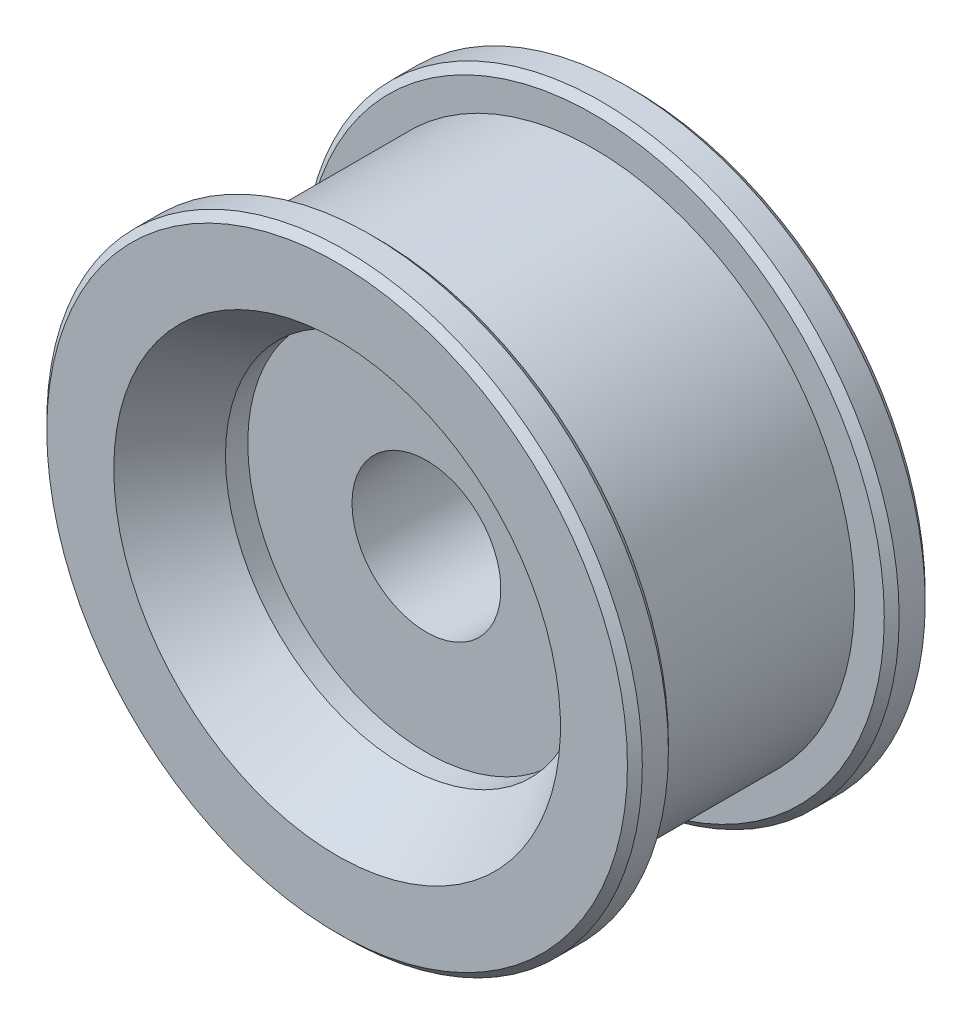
ISO-10303-21;
HEADER;
FILE_DESCRIPTION(('STEP AP214'),'2;1');
FILE_NAME('part.step','',(''),(''),'','','');
FILE_SCHEMA(('AUTOMOTIVE_DESIGN { 1 0 10303 214 1 1 1 1 }'));
ENDSEC;
DATA;
#1=APPLICATION_CONTEXT('core data for automotive mechanical design processes');
#2=APPLICATION_PROTOCOL_DEFINITION('international standard','automotive_design',2000,#1);
#3=PRODUCT_CONTEXT('',#1,'mechanical');
#4=PRODUCT('Part','Part','',(#3));
#5=PRODUCT_RELATED_PRODUCT_CATEGORY('part','',(#4));
#6=PRODUCT_DEFINITION_FORMATION('','',#4);
#7=PRODUCT_DEFINITION_CONTEXT('part definition',#1,'design');
#8=PRODUCT_DEFINITION('design','',#6,#7);
#9=PRODUCT_DEFINITION_SHAPE('','',#8);
#10=(LENGTH_UNIT() NAMED_UNIT(*) SI_UNIT(.MILLI.,.METRE.));
#11=(NAMED_UNIT(*) PLANE_ANGLE_UNIT() SI_UNIT($,.RADIAN.));
#12=(NAMED_UNIT(*) SI_UNIT($,.STERADIAN.) SOLID_ANGLE_UNIT());
#13=UNCERTAINTY_MEASURE_WITH_UNIT(LENGTH_MEASURE(1.E-05),#10,'distance_accuracy_value','');
#14=(GEOMETRIC_REPRESENTATION_CONTEXT(3) GLOBAL_UNCERTAINTY_ASSIGNED_CONTEXT((#13)) GLOBAL_UNIT_ASSIGNED_CONTEXT((#10,
#11,#12)) REPRESENTATION_CONTEXT('',''));
#15=CARTESIAN_POINT('',(0.,0.,0.));
#16=DIRECTION('',(0.,0.,1.));
#17=DIRECTION('',(1.,0.,0.));
#18=AXIS2_PLACEMENT_3D('',#15,#16,#17);
#19=CARTESIAN_POINT('',(0.,5.,-4.));
#20=DIRECTION('',(0.,0.,-1.));
#21=DIRECTION('',(-1.,0.,0.));
#22=AXIS2_PLACEMENT_3D('',#19,#20,#21);
#23=PLANE('',#22);
#24=CARTESIAN_POINT('',(0.,0.,-4.));
#25=DIRECTION('',(0.,0.,-1.));
#26=DIRECTION('',(-1.,0.,0.));
#27=AXIS2_PLACEMENT_3D('',#24,#25,#26);
#28=CIRCLE('',#27,12.);
#29=CARTESIAN_POINT('',(-12.,0.,-4.));
#30=VERTEX_POINT('',#29);
#31=EDGE_CURVE('E71',#30,#30,#28,.T.);
#32=ORIENTED_EDGE('',*,*,#31,.T.);
#33=EDGE_LOOP('',(#32));
#34=FACE_BOUND('',#33,.T.);
#35=CARTESIAN_POINT('',(0.,0.,-4.));
#36=DIRECTION('',(0.,0.,-1.));
#37=DIRECTION('',(-1.,0.,0.));
#38=AXIS2_PLACEMENT_3D('',#35,#36,#37);
#39=CIRCLE('',#38,5.);
#40=CARTESIAN_POINT('',(-5.,0.,-4.));
#41=VERTEX_POINT('',#40);
#42=EDGE_CURVE('E44',#41,#41,#39,.T.);
#43=ORIENTED_EDGE('',*,*,#42,.F.);
#44=EDGE_LOOP('',(#43));
#45=FACE_BOUND('',#44,.T.);
#46=ADVANCED_FACE('F12',(#34,#45),#23,.T.);
#47=CARTESIAN_POINT('',(0.,0.,-20.));
#48=DIRECTION('',(0.,0.,-1.));
#49=DIRECTION('',(-1.,0.,0.));
#50=AXIS2_PLACEMENT_3D('',#47,#48,#49);
#51=CYLINDRICAL_SURFACE('',#50,5.);
#52=ORIENTED_EDGE('',*,*,#42,.T.);
#53=EDGE_LOOP('',(#52));
#54=FACE_BOUND('',#53,.T.);
#55=CARTESIAN_POINT('',(0.,0.,4.));
#56=DIRECTION('',(0.,0.,-1.));
#57=DIRECTION('',(-1.,0.,0.));
#58=AXIS2_PLACEMENT_3D('',#55,#56,#57);
#59=CIRCLE('',#58,5.);
#60=CARTESIAN_POINT('',(-5.,0.,4.));
#61=VERTEX_POINT('',#60);
#62=EDGE_CURVE('E47',#61,#61,#59,.T.);
#63=ORIENTED_EDGE('',*,*,#62,.F.);
#64=EDGE_LOOP('',(#63));
#65=FACE_BOUND('',#64,.T.);
#66=ADVANCED_FACE('F96',(#54,#65),#51,.F.);
#67=CARTESIAN_POINT('',(0.,5.,4.));
#68=DIRECTION('',(0.,0.,-1.));
#69=DIRECTION('',(-1.,0.,0.));
#70=AXIS2_PLACEMENT_3D('',#67,#68,#69);
#71=PLANE('',#70);
#72=CARTESIAN_POINT('',(0.,0.,4.));
#73=DIRECTION('',(0.,0.,-1.));
#74=DIRECTION('',(-1.,0.,0.));
#75=AXIS2_PLACEMENT_3D('',#72,#73,#74);
#76=CIRCLE('',#75,12.);
#77=CARTESIAN_POINT('',(-12.,0.,4.));
#78=VERTEX_POINT('',#77);
#79=EDGE_CURVE('E50',#78,#78,#76,.T.);
#80=ORIENTED_EDGE('',*,*,#79,.F.);
#81=EDGE_LOOP('',(#80));
#82=FACE_BOUND('',#81,.T.);
#83=ORIENTED_EDGE('',*,*,#62,.T.);
#84=EDGE_LOOP('',(#83));
#85=FACE_BOUND('',#84,.T.);
#86=ADVANCED_FACE('F102',(#82,#85),#71,.F.);
#87=CARTESIAN_POINT('',(0.,0.,-20.));
#88=DIRECTION('',(0.,0.,-1.));
#89=DIRECTION('',(-1.,0.,0.));
#90=AXIS2_PLACEMENT_3D('',#87,#88,#89);
#91=CYLINDRICAL_SURFACE('',#90,12.);
#92=CARTESIAN_POINT('',(0.,0.,5.5));
#93=DIRECTION('',(0.,0.,-1.));
#94=DIRECTION('',(-1.,0.,0.));
#95=AXIS2_PLACEMENT_3D('',#92,#93,#94);
#96=CIRCLE('',#95,12.);
#97=CARTESIAN_POINT('',(-12.,0.,5.5));
#98=VERTEX_POINT('',#97);
#99=EDGE_CURVE('E53',#98,#98,#96,.T.);
#100=ORIENTED_EDGE('',*,*,#99,.F.);
#101=EDGE_LOOP('',(#100));
#102=FACE_BOUND('',#101,.T.);
#103=ORIENTED_EDGE('',*,*,#79,.T.);
#104=EDGE_LOOP('',(#103));
#105=FACE_BOUND('',#104,.T.);
#106=ADVANCED_FACE('F154',(#102,#105),#91,.F.);
#107=CARTESIAN_POINT('',(0.,0.,5.5));
#108=DIRECTION('',(0.,0.,1.));
#109=DIRECTION('',(1.,0.,0.));
#110=AXIS2_PLACEMENT_3D('',#107,#108,#109);
#111=CONICAL_SURFACE('',#110,12.,0.588002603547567);
#112=CARTESIAN_POINT('',(0.,0.,10.));
#113=DIRECTION('',(0.,0.,-1.));
#114=DIRECTION('',(-1.,0.,0.));
#115=AXIS2_PLACEMENT_3D('',#112,#113,#114);
#116=CIRCLE('',#115,15.);
#117=CARTESIAN_POINT('',(-15.,0.,10.));
#118=VERTEX_POINT('',#117);
#119=EDGE_CURVE('E56',#118,#118,#116,.T.);
#120=ORIENTED_EDGE('',*,*,#119,.F.);
#121=EDGE_LOOP('',(#120));
#122=FACE_BOUND('',#121,.T.);
#123=ORIENTED_EDGE('',*,*,#99,.T.);
#124=EDGE_LOOP('',(#123));
#125=FACE_BOUND('',#124,.T.);
#126=ADVANCED_FACE('F151',(#122,#125),#111,.F.);
#127=CARTESIAN_POINT('',(0.,20.,10.));
#128=DIRECTION('',(0.,0.,1.));
#129=DIRECTION('',(1.,0.,0.));
#130=AXIS2_PLACEMENT_3D('',#127,#128,#129);
#131=PLANE('',#130);
#132=CARTESIAN_POINT('',(0.,0.,10.));
#133=DIRECTION('',(0.,0.,1.));
#134=DIRECTION('',(1.,0.,0.));
#135=AXIS2_PLACEMENT_3D('',#132,#133,#134);
#136=CIRCLE('',#135,19.5);
#137=CARTESIAN_POINT('',(19.5,0.,10.));
#138=VERTEX_POINT('',#137);
#139=EDGE_CURVE('E8',#138,#138,#136,.T.);
#140=ORIENTED_EDGE('',*,*,#139,.T.);
#141=EDGE_LOOP('',(#140));
#142=FACE_BOUND('',#141,.T.);
#143=ORIENTED_EDGE('',*,*,#119,.T.);
#144=EDGE_LOOP('',(#143));
#145=FACE_BOUND('',#144,.T.);
#146=ADVANCED_FACE('F148',(#142,#145),#131,.T.);
#147=CARTESIAN_POINT('',(0.,0.,-20.));
#148=DIRECTION('',(0.,0.,-1.));
#149=DIRECTION('',(-1.,0.,0.));
#150=AXIS2_PLACEMENT_3D('',#147,#148,#149);
#151=CYLINDRICAL_SURFACE('',#150,20.);
#152=CARTESIAN_POINT('',(0.,0.,7.75));
#153=DIRECTION('',(0.,0.,1.));
#154=DIRECTION('',(1.,0.,0.));
#155=AXIS2_PLACEMENT_3D('',#152,#153,#154);
#156=CIRCLE('',#155,20.);
#157=CARTESIAN_POINT('',(20.,0.,7.75));
#158=VERTEX_POINT('',#157);
#159=EDGE_CURVE('E19',#158,#158,#156,.T.);
#160=ORIENTED_EDGE('',*,*,#159,.T.);
#161=EDGE_LOOP('',(#160));
#162=FACE_BOUND('',#161,.T.);
#163=CARTESIAN_POINT('',(0.,0.,9.5));
#164=DIRECTION('',(0.,0.,1.));
#165=DIRECTION('',(1.,0.,0.));
#166=AXIS2_PLACEMENT_3D('',#163,#164,#165);
#167=CIRCLE('',#166,20.);
#168=CARTESIAN_POINT('',(20.,0.,9.5));
#169=VERTEX_POINT('',#168);
#170=EDGE_CURVE('E23',#169,#169,#167,.F.);
#171=ORIENTED_EDGE('',*,*,#170,.T.);
#172=EDGE_LOOP('',(#171));
#173=FACE_BOUND('',#172,.T.);
#174=ADVANCED_FACE('F124',(#162,#173),#151,.T.);
#175=CARTESIAN_POINT('',(0.,20.,7.25));
#176=DIRECTION('',(0.,0.,1.));
#177=DIRECTION('',(1.,0.,0.));
#178=AXIS2_PLACEMENT_3D('',#175,#176,#177);
#179=PLANE('',#178);
#180=CARTESIAN_POINT('',(0.,0.,7.25));
#181=DIRECTION('',(0.,0.,1.));
#182=DIRECTION('',(1.,0.,0.));
#183=AXIS2_PLACEMENT_3D('',#180,#181,#182);
#184=CIRCLE('',#183,19.5);
#185=CARTESIAN_POINT('',(19.5,0.,7.25));
#186=VERTEX_POINT('',#185);
#187=EDGE_CURVE('E27',#186,#186,#184,.F.);
#188=ORIENTED_EDGE('',*,*,#187,.T.);
#189=EDGE_LOOP('',(#188));
#190=FACE_BOUND('',#189,.T.);
#191=CARTESIAN_POINT('',(0.,0.,7.25));
#192=DIRECTION('',(0.,0.,-1.));
#193=DIRECTION('',(-1.,0.,0.));
#194=AXIS2_PLACEMENT_3D('',#191,#192,#193);
#195=CIRCLE('',#194,17.5);
#196=CARTESIAN_POINT('',(-17.5,0.,7.25));
#197=VERTEX_POINT('',#196);
#198=EDGE_CURVE('E59',#197,#197,#195,.T.);
#199=ORIENTED_EDGE('',*,*,#198,.F.);
#200=EDGE_LOOP('',(#199));
#201=FACE_BOUND('',#200,.T.);
#202=ADVANCED_FACE('F120',(#190,#201),#179,.F.);
#203=CARTESIAN_POINT('',(0.,0.,-20.));
#204=DIRECTION('',(0.,0.,-1.));
#205=DIRECTION('',(-1.,0.,0.));
#206=AXIS2_PLACEMENT_3D('',#203,#204,#205);
#207=CYLINDRICAL_SURFACE('',#206,17.5);
#208=ORIENTED_EDGE('',*,*,#198,.T.);
#209=EDGE_LOOP('',(#208));
#210=FACE_BOUND('',#209,.T.);
#211=CARTESIAN_POINT('',(0.,0.,-7.25));
#212=DIRECTION('',(0.,0.,-1.));
#213=DIRECTION('',(-1.,0.,0.));
#214=AXIS2_PLACEMENT_3D('',#211,#212,#213);
#215=CIRCLE('',#214,17.5);
#216=CARTESIAN_POINT('',(-17.5,0.,-7.25));
#217=VERTEX_POINT('',#216);
#218=EDGE_CURVE('E62',#217,#217,#215,.T.);
#219=ORIENTED_EDGE('',*,*,#218,.F.);
#220=EDGE_LOOP('',(#219));
#221=FACE_BOUND('',#220,.T.);
#222=ADVANCED_FACE('F123',(#210,#221),#207,.T.);
#223=CARTESIAN_POINT('',(0.,20.,-7.25));
#224=DIRECTION('',(0.,0.,1.));
#225=DIRECTION('',(1.,0.,0.));
#226=AXIS2_PLACEMENT_3D('',#223,#224,#225);
#227=PLANE('',#226);
#228=CARTESIAN_POINT('',(0.,0.,-7.25));
#229=DIRECTION('',(0.,0.,1.));
#230=DIRECTION('',(1.,0.,0.));
#231=AXIS2_PLACEMENT_3D('',#228,#229,#230);
#232=CIRCLE('',#231,19.5);
#233=CARTESIAN_POINT('',(19.5,0.,-7.25));
#234=VERTEX_POINT('',#233);
#235=EDGE_CURVE('E32',#234,#234,#232,.T.);
#236=ORIENTED_EDGE('',*,*,#235,.T.);
#237=EDGE_LOOP('',(#236));
#238=FACE_BOUND('',#237,.T.);
#239=ORIENTED_EDGE('',*,*,#218,.T.);
#240=EDGE_LOOP('',(#239));
#241=FACE_BOUND('',#240,.T.);
#242=ADVANCED_FACE('F130',(#238,#241),#227,.T.);
#243=CARTESIAN_POINT('',(0.,0.,-20.));
#244=DIRECTION('',(0.,0.,-1.));
#245=DIRECTION('',(-1.,0.,0.));
#246=AXIS2_PLACEMENT_3D('',#243,#244,#245);
#247=CYLINDRICAL_SURFACE('',#246,20.);
#248=CARTESIAN_POINT('',(0.,0.,-9.5));
#249=DIRECTION('',(0.,0.,1.));
#250=DIRECTION('',(1.,0.,0.));
#251=AXIS2_PLACEMENT_3D('',#248,#249,#250);
#252=CIRCLE('',#251,20.);
#253=CARTESIAN_POINT('',(20.,0.,-9.5));
#254=VERTEX_POINT('',#253);
#255=EDGE_CURVE('E35',#254,#254,#252,.T.);
#256=ORIENTED_EDGE('',*,*,#255,.T.);
#257=EDGE_LOOP('',(#256));
#258=FACE_BOUND('',#257,.T.);
#259=CARTESIAN_POINT('',(0.,0.,-7.75));
#260=DIRECTION('',(0.,0.,1.));
#261=DIRECTION('',(1.,0.,0.));
#262=AXIS2_PLACEMENT_3D('',#259,#260,#261);
#263=CIRCLE('',#262,20.);
#264=CARTESIAN_POINT('',(20.,0.,-7.75));
#265=VERTEX_POINT('',#264);
#266=EDGE_CURVE('E38',#265,#265,#263,.F.);
#267=ORIENTED_EDGE('',*,*,#266,.T.);
#268=EDGE_LOOP('',(#267));
#269=FACE_BOUND('',#268,.T.);
#270=ADVANCED_FACE('F135',(#258,#269),#247,.T.);
#271=CARTESIAN_POINT('',(0.,20.,-10.));
#272=DIRECTION('',(0.,0.,1.));
#273=DIRECTION('',(1.,0.,0.));
#274=AXIS2_PLACEMENT_3D('',#271,#272,#273);
#275=PLANE('',#274);
#276=CARTESIAN_POINT('',(0.,0.,-10.));
#277=DIRECTION('',(0.,0.,1.));
#278=DIRECTION('',(1.,0.,0.));
#279=AXIS2_PLACEMENT_3D('',#276,#277,#278);
#280=CIRCLE('',#279,19.5);
#281=CARTESIAN_POINT('',(19.5,0.,-10.));
#282=VERTEX_POINT('',#281);
#283=EDGE_CURVE('E41',#282,#282,#280,.F.);
#284=ORIENTED_EDGE('',*,*,#283,.T.);
#285=EDGE_LOOP('',(#284));
#286=FACE_BOUND('',#285,.T.);
#287=CARTESIAN_POINT('',(0.,0.,-10.));
#288=DIRECTION('',(0.,0.,-1.));
#289=DIRECTION('',(-1.,0.,0.));
#290=AXIS2_PLACEMENT_3D('',#287,#288,#289);
#291=CIRCLE('',#290,15.);
#292=CARTESIAN_POINT('',(-15.,0.,-10.));
#293=VERTEX_POINT('',#292);
#294=EDGE_CURVE('E65',#293,#293,#291,.T.);
#295=ORIENTED_EDGE('',*,*,#294,.F.);
#296=EDGE_LOOP('',(#295));
#297=FACE_BOUND('',#296,.T.);
#298=ADVANCED_FACE('F92',(#286,#297),#275,.F.);
#299=CARTESIAN_POINT('',(0.,0.,-5.5));
#300=DIRECTION('',(0.,0.,-1.));
#301=DIRECTION('',(-1.,0.,0.));
#302=AXIS2_PLACEMENT_3D('',#299,#300,#301);
#303=CONICAL_SURFACE('',#302,12.,0.588002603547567);
#304=ORIENTED_EDGE('',*,*,#294,.T.);
#305=EDGE_LOOP('',(#304));
#306=FACE_BOUND('',#305,.T.);
#307=CARTESIAN_POINT('',(0.,0.,-5.5));
#308=DIRECTION('',(0.,0.,-1.));
#309=DIRECTION('',(-1.,0.,0.));
#310=AXIS2_PLACEMENT_3D('',#307,#308,#309);
#311=CIRCLE('',#310,12.);
#312=CARTESIAN_POINT('',(-12.,0.,-5.5));
#313=VERTEX_POINT('',#312);
#314=EDGE_CURVE('E68',#313,#313,#311,.T.);
#315=ORIENTED_EDGE('',*,*,#314,.F.);
#316=EDGE_LOOP('',(#315));
#317=FACE_BOUND('',#316,.T.);
#318=ADVANCED_FACE('F80',(#306,#317),#303,.F.);
#319=CARTESIAN_POINT('',(0.,0.,-20.));
#320=DIRECTION('',(0.,0.,-1.));
#321=DIRECTION('',(-1.,0.,0.));
#322=AXIS2_PLACEMENT_3D('',#319,#320,#321);
#323=CYLINDRICAL_SURFACE('',#322,12.);
#324=ORIENTED_EDGE('',*,*,#314,.T.);
#325=EDGE_LOOP('',(#324));
#326=FACE_BOUND('',#325,.T.);
#327=ORIENTED_EDGE('',*,*,#31,.F.);
#328=EDGE_LOOP('',(#327));
#329=FACE_BOUND('',#328,.T.);
#330=ADVANCED_FACE('F77',(#326,#329),#323,.F.);
#331=CARTESIAN_POINT('',(0.,0.,-10.));
#332=DIRECTION('',(0.,0.,1.));
#333=DIRECTION('',(1.,0.,0.));
#334=AXIS2_PLACEMENT_3D('',#331,#332,#333);
#335=CONICAL_SURFACE('',#334,19.5,0.785398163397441);
#336=ORIENTED_EDGE('',*,*,#255,.F.);
#337=EDGE_LOOP('',(#336));
#338=FACE_BOUND('',#337,.T.);
#339=ORIENTED_EDGE('',*,*,#283,.F.);
#340=EDGE_LOOP('',(#339));
#341=FACE_BOUND('',#340,.T.);
#342=ADVANCED_FACE('F79',(#338,#341),#335,.T.);
#343=CARTESIAN_POINT('',(0.,0.,-7.75));
#344=DIRECTION('',(0.,0.,-1.));
#345=DIRECTION('',(-1.,0.,0.));
#346=AXIS2_PLACEMENT_3D('',#343,#344,#345);
#347=CONICAL_SURFACE('',#346,20.,0.785398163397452);
#348=ORIENTED_EDGE('',*,*,#235,.F.);
#349=EDGE_LOOP('',(#348));
#350=FACE_BOUND('',#349,.T.);
#351=ORIENTED_EDGE('',*,*,#266,.F.);
#352=EDGE_LOOP('',(#351));
#353=FACE_BOUND('',#352,.T.);
#354=ADVANCED_FACE('F89',(#350,#353),#347,.T.);
#355=CARTESIAN_POINT('',(0.,0.,7.25));
#356=DIRECTION('',(0.,0.,1.));
#357=DIRECTION('',(1.,0.,0.));
#358=AXIS2_PLACEMENT_3D('',#355,#356,#357);
#359=CONICAL_SURFACE('',#358,19.5,0.785398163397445);
#360=ORIENTED_EDGE('',*,*,#159,.F.);
#361=EDGE_LOOP('',(#360));
#362=FACE_BOUND('',#361,.T.);
#363=ORIENTED_EDGE('',*,*,#187,.F.);
#364=EDGE_LOOP('',(#363));
#365=FACE_BOUND('',#364,.T.);
#366=ADVANCED_FACE('F108',(#362,#365),#359,.T.);
#367=CARTESIAN_POINT('',(0.,0.,9.5));
#368=DIRECTION('',(0.,0.,-1.));
#369=DIRECTION('',(-1.,0.,0.));
#370=AXIS2_PLACEMENT_3D('',#367,#368,#369);
#371=CONICAL_SURFACE('',#370,20.,0.785398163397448);
#372=ORIENTED_EDGE('',*,*,#139,.F.);
#373=EDGE_LOOP('',(#372));
#374=FACE_BOUND('',#373,.T.);
#375=ORIENTED_EDGE('',*,*,#170,.F.);
#376=EDGE_LOOP('',(#375));
#377=FACE_BOUND('',#376,.T.);
#378=ADVANCED_FACE('F14',(#374,#377),#371,.T.);
#379=CLOSED_SHELL('',(#46,#66,#86,#106,#126,#146,#174,#202,#222,#242,#270,#298,#318,#330,#342,
#354,#366,#378));
#380=MANIFOLD_SOLID_BREP('B1',#379);
#381=ADVANCED_BREP_SHAPE_REPRESENTATION('',(#18,#380),#14);
#382=SHAPE_DEFINITION_REPRESENTATION(#9,#381);
ENDSEC;
END-ISO-10303-21;
